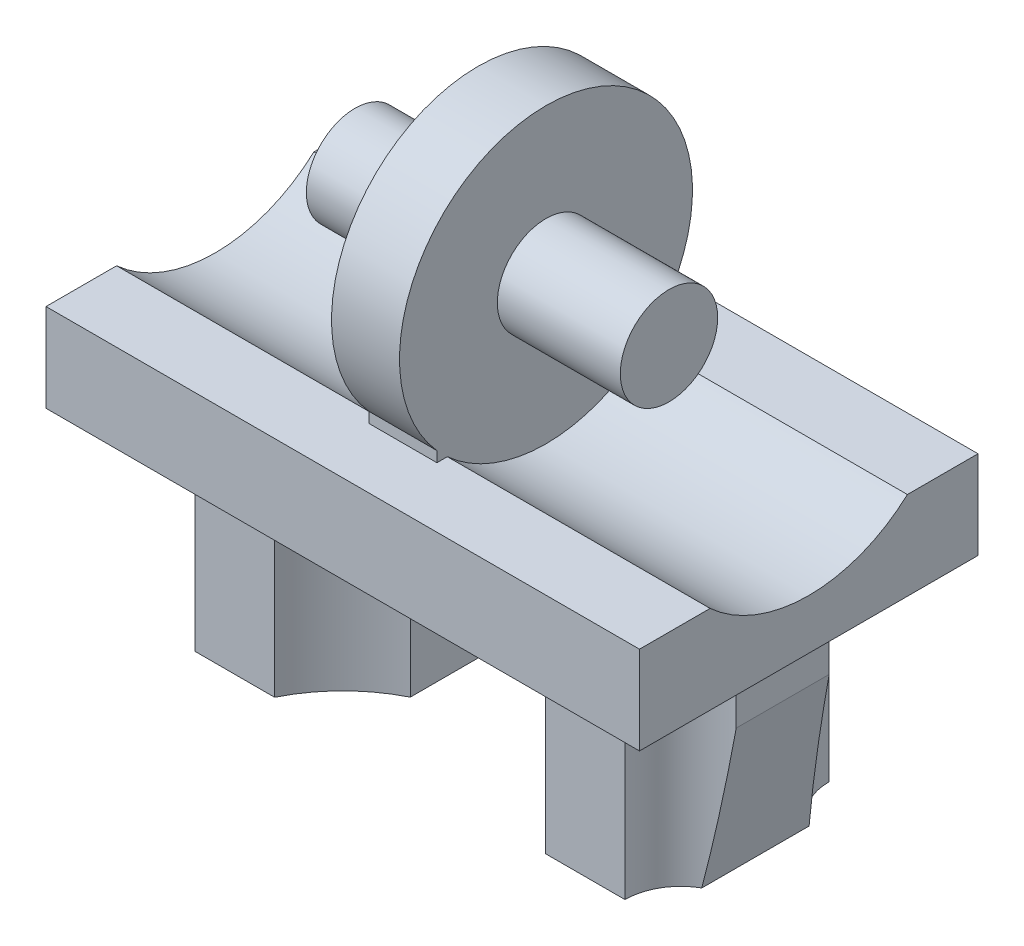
ISO-10303-21;
HEADER;
FILE_DESCRIPTION(('STEP AP214'),'2;1');
FILE_NAME('part.step','',(''),(''),'','','');
FILE_SCHEMA(('AUTOMOTIVE_DESIGN { 1 0 10303 214 1 1 1 1 }'));
ENDSEC;
DATA;
#1=APPLICATION_CONTEXT('core data for automotive mechanical design processes');
#2=APPLICATION_PROTOCOL_DEFINITION('international standard','automotive_design',2000,#1);
#3=PRODUCT_CONTEXT('',#1,'mechanical');
#4=PRODUCT('Part','Part','',(#3));
#5=PRODUCT_RELATED_PRODUCT_CATEGORY('part','',(#4));
#6=PRODUCT_DEFINITION_FORMATION('','',#4);
#7=PRODUCT_DEFINITION_CONTEXT('part definition',#1,'design');
#8=PRODUCT_DEFINITION('design','',#6,#7);
#9=PRODUCT_DEFINITION_SHAPE('','',#8);
#10=(LENGTH_UNIT() NAMED_UNIT(*) SI_UNIT(.MILLI.,.METRE.));
#11=(NAMED_UNIT(*) PLANE_ANGLE_UNIT() SI_UNIT($,.RADIAN.));
#12=(NAMED_UNIT(*) SI_UNIT($,.STERADIAN.) SOLID_ANGLE_UNIT());
#13=UNCERTAINTY_MEASURE_WITH_UNIT(LENGTH_MEASURE(1.E-05),#10,'distance_accuracy_value','');
#14=(GEOMETRIC_REPRESENTATION_CONTEXT(3) GLOBAL_UNCERTAINTY_ASSIGNED_CONTEXT((#13)) GLOBAL_UNIT_ASSIGNED_CONTEXT((#10,
#11,#12)) REPRESENTATION_CONTEXT('',''));
#15=CARTESIAN_POINT('',(0.,0.,0.));
#16=DIRECTION('',(0.,0.,1.));
#17=DIRECTION('',(1.,0.,0.));
#18=AXIS2_PLACEMENT_3D('',#15,#16,#17);
#19=CARTESIAN_POINT('',(3.74,3.4736,1.2064));
#20=DIRECTION('',(1.,0.,0.));
#21=DIRECTION('',(0.,0.,-1.));
#22=AXIS2_PLACEMENT_3D('',#19,#20,#21);
#23=PLANE('',#22);
#24=CARTESIAN_POINT('',(3.73999999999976,4.68,0.));
#25=DIRECTION('',(1.,0.,0.));
#26=DIRECTION('',(0.,0.,-1.));
#27=AXIS2_PLACEMENT_3D('',#24,#25,#26);
#28=CIRCLE('',#27,1.16);
#29=CARTESIAN_POINT('',(3.73999999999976,4.68,-1.16));
#30=VERTEX_POINT('',#29);
#31=EDGE_CURVE('E20',#30,#30,#28,.T.);
#32=ORIENTED_EDGE('',*,*,#31,.T.);
#33=EDGE_LOOP('',(#32));
#34=FACE_BOUND('',#33,.T.);
#35=ADVANCED_FACE('F16',(#34),#23,.T.);
#36=CARTESIAN_POINT('',(-7.3528,0.,4.1938));
#37=DIRECTION('',(0.,-1.,0.));
#38=DIRECTION('',(0.,0.,-1.));
#39=AXIS2_PLACEMENT_3D('',#36,#37,#38);
#40=PLANE('',#39);
#41=DIRECTION('',(0.,0.,1.));
#42=VECTOR('',#41,1.);
#43=CARTESIAN_POINT('',(-5.177740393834,0.,0.));
#44=LINE('',#43,#42);
#45=CARTESIAN_POINT('',(-5.17774039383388,0.,-1.19052334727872));
#46=VERTEX_POINT('',#45);
#47=CARTESIAN_POINT('',(-5.17774039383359,0.,1.19052334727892));
#48=VERTEX_POINT('',#47);
#49=EDGE_CURVE('E227',#46,#48,#44,.T.);
#50=ORIENTED_EDGE('',*,*,#49,.F.);
#51=CARTESIAN_POINT('',(-4.35,0.,0.));
#52=DIRECTION('',(0.,-1.,0.));
#53=DIRECTION('',(0.,0.,-1.));
#54=AXIS2_PLACEMENT_3D('',#51,#52,#53);
#55=CIRCLE('',#54,1.45);
#56=EDGE_CURVE('E232',#48,#46,#55,.F.);
#57=ORIENTED_EDGE('',*,*,#56,.F.);
#58=EDGE_LOOP('',(#50,#57));
#59=FACE_BOUND('',#58,.T.);
#60=ADVANCED_FACE('F239',(#59),#40,.T.);
#61=CARTESIAN_POINT('',(-7.3528,0.,4.1938));
#62=DIRECTION('',(0.,-1.,0.));
#63=DIRECTION('',(0.,0.,-1.));
#64=AXIS2_PLACEMENT_3D('',#61,#62,#63);
#65=PLANE('',#64);
#66=CARTESIAN_POINT('',(4.35,0.,0.));
#67=DIRECTION('',(0.,-1.,0.));
#68=DIRECTION('',(0.,0.,-1.));
#69=AXIS2_PLACEMENT_3D('',#66,#67,#68);
#70=CIRCLE('',#69,1.45);
#71=CARTESIAN_POINT('',(5.177740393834,0.,-1.19052334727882));
#72=VERTEX_POINT('',#71);
#73=CARTESIAN_POINT('',(5.177740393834,0.,1.19052334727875));
#74=VERTEX_POINT('',#73);
#75=EDGE_CURVE('E245',#72,#74,#70,.F.);
#76=ORIENTED_EDGE('',*,*,#75,.F.);
#77=DIRECTION('',(0.,0.,-1.));
#78=VECTOR('',#77,1.);
#79=CARTESIAN_POINT('',(5.177740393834,0.,0.));
#80=LINE('',#79,#78);
#81=EDGE_CURVE('E251',#74,#72,#80,.T.);
#82=ORIENTED_EDGE('',*,*,#81,.F.);
#83=EDGE_LOOP('',(#76,#82));
#84=FACE_BOUND('',#83,.T.);
#85=ADVANCED_FACE('F384',(#84),#65,.T.);
#86=CARTESIAN_POINT('',(0.809999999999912,4.68,0.));
#87=DIRECTION('',(1.,0.,0.));
#88=DIRECTION('',(0.,0.,-1.));
#89=AXIS2_PLACEMENT_3D('',#86,#87,#88);
#90=CYLINDRICAL_SURFACE('',#89,1.16);
#91=ORIENTED_EDGE('',*,*,#31,.F.);
#92=EDGE_LOOP('',(#91));
#93=FACE_BOUND('',#92,.T.);
#94=CARTESIAN_POINT('',(0.809999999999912,4.68,0.));
#95=DIRECTION('',(1.,0.,0.));
#96=DIRECTION('',(0.,0.,-1.));
#97=AXIS2_PLACEMENT_3D('',#94,#95,#96);
#98=CIRCLE('',#97,1.16);
#99=CARTESIAN_POINT('',(0.809999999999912,4.68,-1.16));
#100=VERTEX_POINT('',#99);
#101=EDGE_CURVE('E364',#100,#100,#98,.F.);
#102=ORIENTED_EDGE('',*,*,#101,.F.);
#103=EDGE_LOOP('',(#102));
#104=FACE_BOUND('',#103,.T.);
#105=ADVANCED_FACE('F386',(#93,#104),#90,.T.);
#106=CARTESIAN_POINT('',(-5.177740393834,0.0968,-1.23814428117));
#107=DIRECTION('',(1.,0.,0.));
#108=DIRECTION('',(0.,0.,1.));
#109=AXIS2_PLACEMENT_3D('',#106,#107,#108);
#110=PLANE('',#109);
#111=DIRECTION('',(0.,0.,1.));
#112=VECTOR('',#111,1.);
#113=CARTESIAN_POINT('',(-5.177740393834,-4.84,0.));
#114=LINE('',#113,#112);
#115=CARTESIAN_POINT('',(-5.17774039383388,-4.83999999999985,-1.19052334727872));
#116=VERTEX_POINT('',#115);
#117=CARTESIAN_POINT('',(-5.17774039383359,-4.83999999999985,1.19052334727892));
#118=VERTEX_POINT('',#117);
#119=EDGE_CURVE('E243',#116,#118,#114,.T.);
#120=ORIENTED_EDGE('',*,*,#119,.F.);
#121=DIRECTION('',(0.,-1.,0.));
#122=VECTOR('',#121,1.);
#123=CARTESIAN_POINT('',(-5.17774039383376,-2.42,-1.1905233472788));
#124=LINE('',#123,#122);
#125=EDGE_CURVE('E235',#46,#116,#124,.T.);
#126=ORIENTED_EDGE('',*,*,#125,.F.);
#127=ORIENTED_EDGE('',*,*,#49,.T.);
#128=DIRECTION('',(0.,1.,0.));
#129=VECTOR('',#128,1.);
#130=CARTESIAN_POINT('',(-5.17774039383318,-2.42,1.19052334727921));
#131=LINE('',#130,#129);
#132=EDGE_CURVE('E237',#118,#48,#131,.T.);
#133=ORIENTED_EDGE('',*,*,#132,.F.);
#134=EDGE_LOOP('',(#120,#126,#127,#133));
#135=FACE_BOUND('',#134,.T.);
#136=ADVANCED_FACE('F242',(#135),#110,.T.);
#137=CARTESIAN_POINT('',(-4.35,0.,0.));
#138=DIRECTION('',(0.,-1.,0.));
#139=DIRECTION('',(0.,0.,-1.));
#140=AXIS2_PLACEMENT_3D('',#137,#138,#139);
#141=CYLINDRICAL_SURFACE('',#140,1.45);
#142=CARTESIAN_POINT('',(-4.35,-4.83999999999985,0.));
#143=DIRECTION('',(0.,-1.,0.));
#144=DIRECTION('',(0.,0.,-1.));
#145=AXIS2_PLACEMENT_3D('',#142,#143,#144);
#146=CIRCLE('',#145,1.45);
#147=EDGE_CURVE('E361',#118,#116,#146,.F.);
#148=ORIENTED_EDGE('',*,*,#147,.F.);
#149=ORIENTED_EDGE('',*,*,#132,.T.);
#150=ORIENTED_EDGE('',*,*,#56,.T.);
#151=ORIENTED_EDGE('',*,*,#125,.T.);
#152=EDGE_LOOP('',(#148,#149,#150,#151));
#153=FACE_BOUND('',#152,.T.);
#154=ADVANCED_FACE('F234',(#153),#141,.F.);
#155=CARTESIAN_POINT('',(4.35,0.,0.));
#156=DIRECTION('',(0.,-1.,0.));
#157=DIRECTION('',(0.,0.,-1.));
#158=AXIS2_PLACEMENT_3D('',#155,#156,#157);
#159=CYLINDRICAL_SURFACE('',#158,1.45);
#160=CARTESIAN_POINT('',(4.35,-4.83999999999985,0.));
#161=DIRECTION('',(0.,-1.,0.));
#162=DIRECTION('',(0.,0.,-1.));
#163=AXIS2_PLACEMENT_3D('',#160,#161,#162);
#164=CIRCLE('',#163,1.45);
#165=CARTESIAN_POINT('',(5.177740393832,-4.83999999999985,-1.19052334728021));
#166=VERTEX_POINT('',#165);
#167=CARTESIAN_POINT('',(5.177740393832,-4.83999999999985,1.19052334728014));
#168=VERTEX_POINT('',#167);
#169=EDGE_CURVE('E352',#166,#168,#164,.F.);
#170=ORIENTED_EDGE('',*,*,#169,.F.);
#171=DIRECTION('',(0.,-1.,0.));
#172=VECTOR('',#171,1.);
#173=CARTESIAN_POINT('',(5.177740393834,-2.42,-1.190523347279));
#174=LINE('',#173,#172);
#175=EDGE_CURVE('E248',#72,#166,#174,.T.);
#176=ORIENTED_EDGE('',*,*,#175,.F.);
#177=ORIENTED_EDGE('',*,*,#75,.T.);
#178=DIRECTION('',(0.,1.,0.));
#179=VECTOR('',#178,1.);
#180=CARTESIAN_POINT('',(5.177740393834,-2.42,1.19052334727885));
#181=LINE('',#180,#179);
#182=EDGE_CURVE('E376',#168,#74,#181,.T.);
#183=ORIENTED_EDGE('',*,*,#182,.F.);
#184=EDGE_LOOP('',(#170,#176,#177,#183));
#185=FACE_BOUND('',#184,.T.);
#186=ADVANCED_FACE('F375',(#185),#159,.F.);
#187=CARTESIAN_POINT('',(5.177740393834,0.0968,1.23814428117));
#188=DIRECTION('',(-1.,0.,0.));
#189=DIRECTION('',(0.,0.,-1.));
#190=AXIS2_PLACEMENT_3D('',#187,#188,#189);
#191=PLANE('',#190);
#192=DIRECTION('',(0.,0.,-1.));
#193=VECTOR('',#192,1.);
#194=CARTESIAN_POINT('',(5.17774039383,-4.84,0.));
#195=LINE('',#194,#193);
#196=EDGE_CURVE('E354',#168,#166,#195,.T.);
#197=ORIENTED_EDGE('',*,*,#196,.F.);
#198=ORIENTED_EDGE('',*,*,#182,.T.);
#199=ORIENTED_EDGE('',*,*,#81,.T.);
#200=ORIENTED_EDGE('',*,*,#175,.T.);
#201=EDGE_LOOP('',(#197,#198,#199,#200));
#202=FACE_BOUND('',#201,.T.);
#203=ADVANCED_FACE('F381',(#202),#191,.T.);
#204=CARTESIAN_POINT('',(-3.74,3.4736,1.2064));
#205=DIRECTION('',(1.,0.,0.));
#206=DIRECTION('',(0.,0.,-1.));
#207=AXIS2_PLACEMENT_3D('',#204,#205,#206);
#208=PLANE('',#207);
#209=CARTESIAN_POINT('',(-3.73999999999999,4.68,0.));
#210=DIRECTION('',(1.,0.,0.));
#211=DIRECTION('',(0.,1.,0.));
#212=AXIS2_PLACEMENT_3D('',#209,#210,#211);
#213=CIRCLE('',#212,1.16);
#214=CARTESIAN_POINT('',(-3.73999999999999,5.84,0.));
#215=VERTEX_POINT('',#214);
#216=EDGE_CURVE('E344',#215,#215,#213,.F.);
#217=ORIENTED_EDGE('',*,*,#216,.T.);
#218=EDGE_LOOP('',(#217));
#219=FACE_BOUND('',#218,.T.);
#220=ADVANCED_FACE('F679',(#219),#208,.F.);
#221=CARTESIAN_POINT('',(0.81,1.0504,3.632449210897));
#222=DIRECTION('',(1.,0.,0.));
#223=DIRECTION('',(0.,0.,-1.));
#224=AXIS2_PLACEMENT_3D('',#221,#222,#223);
#225=PLANE('',#224);
#226=ORIENTED_EDGE('',*,*,#101,.T.);
#227=EDGE_LOOP('',(#226));
#228=FACE_BOUND('',#227,.T.);
#229=DIRECTION('',(0.,0.,-1.));
#230=VECTOR('',#229,1.);
#231=CARTESIAN_POINT('',(0.81,2.1,0.));
#232=LINE('',#231,#230);
#233=CARTESIAN_POINT('',(0.81,2.1,2.59830714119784));
#234=VERTEX_POINT('',#233);
#235=CARTESIAN_POINT('',(0.809999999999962,2.1,2.35025530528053));
#236=VERTEX_POINT('',#235);
#237=EDGE_CURVE('E368',#234,#236,#232,.T.);
#238=ORIENTED_EDGE('',*,*,#237,.T.);
#239=CARTESIAN_POINT('',(0.809999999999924,4.68,0.));
#240=DIRECTION('',(1.,0.,0.));
#241=DIRECTION('',(0.,0.,-1.));
#242=AXIS2_PLACEMENT_3D('',#239,#240,#241);
#243=CIRCLE('',#242,3.49);
#244=CARTESIAN_POINT('',(0.809999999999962,2.1,-2.35025530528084));
#245=VERTEX_POINT('',#244);
#246=EDGE_CURVE('E339',#245,#236,#243,.F.);
#247=ORIENTED_EDGE('',*,*,#246,.F.);
#248=DIRECTION('',(0.,0.,-1.));
#249=VECTOR('',#248,1.);
#250=CARTESIAN_POINT('',(0.81,2.1,0.));
#251=LINE('',#250,#249);
#252=CARTESIAN_POINT('',(0.81,2.10000000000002,-2.59830714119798));
#253=VERTEX_POINT('',#252);
#254=EDGE_CURVE('E383',#245,#253,#251,.T.);
#255=ORIENTED_EDGE('',*,*,#254,.T.);
#256=DIRECTION('',(0.,-1.,0.));
#257=VECTOR('',#256,1.);
#258=CARTESIAN_POINT('',(0.81,2.225,-2.598307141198));
#259=LINE('',#258,#257);
#260=CARTESIAN_POINT('',(0.809999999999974,2.34999999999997,-2.598307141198));
#261=VERTEX_POINT('',#260);
#262=EDGE_CURVE('E343',#261,#253,#259,.T.);
#263=ORIENTED_EDGE('',*,*,#262,.F.);
#264=CARTESIAN_POINT('',(0.809999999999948,4.68,0.));
#265=DIRECTION('',(1.,0.,0.));
#266=DIRECTION('',(0.,1.,0.));
#267=AXIS2_PLACEMENT_3D('',#264,#265,#266);
#268=CIRCLE('',#267,3.49);
#269=CARTESIAN_POINT('',(0.809999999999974,2.34999999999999,2.598307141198));
#270=VERTEX_POINT('',#269);
#271=EDGE_CURVE('E348',#261,#270,#268,.T.);
#272=ORIENTED_EDGE('',*,*,#271,.T.);
#273=DIRECTION('',(0.,-1.,0.));
#274=VECTOR('',#273,1.);
#275=CARTESIAN_POINT('',(0.81,4.68,2.598307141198));
#276=LINE('',#275,#274);
#277=EDGE_CURVE('E587',#270,#234,#276,.T.);
#278=ORIENTED_EDGE('',*,*,#277,.T.);
#279=EDGE_LOOP('',(#238,#247,#255,#263,#272,#278));
#280=FACE_BOUND('',#279,.T.);
#281=ADVANCED_FACE('F586',(#228,#280),#225,.T.);
#282=CARTESIAN_POINT('',(-5.787,-4.9108,-1.328889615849));
#283=DIRECTION('',(0.983557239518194,0.180596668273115,0.));
#284=DIRECTION('',(-0.180596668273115,0.983557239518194,0.));
#285=AXIS2_PLACEMENT_3D('',#282,#283,#284);
#286=PLANE('',#285);
#287=CARTESIAN_POINT('',(-6.45,-1.3,2.4325));
#288=DIRECTION('',(0.983557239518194,0.180596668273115,0.));
#289=DIRECTION('',(0.180596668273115,-0.983557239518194,0.));
#290=AXIS2_PLACEMENT_3D('',#287,#288,#289);
#291=ELLIPSE('',#290,7.33732750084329,1.325096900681);
#292=CARTESIAN_POINT('',(-6.44999999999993,-1.30000000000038,1.107403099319));
#293=VERTEX_POINT('',#292);
#294=CARTESIAN_POINT('',(-5.80000000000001,-4.83999999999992,1.27777847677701));
#295=VERTEX_POINT('',#294);
#296=EDGE_CURVE('E324',#293,#295,#291,.F.);
#297=ORIENTED_EDGE('',*,*,#296,.F.);
#298=DIRECTION('',(0.,0.,1.));
#299=VECTOR('',#298,1.);
#300=CARTESIAN_POINT('',(-6.45,-1.3,0.));
#301=LINE('',#300,#299);
#302=CARTESIAN_POINT('',(-6.45,-1.3,-1.10740309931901));
#303=VERTEX_POINT('',#302);
#304=EDGE_CURVE('E330',#303,#293,#301,.T.);
#305=ORIENTED_EDGE('',*,*,#304,.F.);
#306=CARTESIAN_POINT('',(-6.45,-1.3,-2.4325));
#307=DIRECTION('',(0.983557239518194,0.180596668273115,0.));
#308=DIRECTION('',(0.180596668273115,-0.983557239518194,0.));
#309=AXIS2_PLACEMENT_3D('',#306,#307,#308);
#310=ELLIPSE('',#309,7.33732750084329,1.325096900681);
#311=CARTESIAN_POINT('',(-5.80000000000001,-4.83999999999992,-1.27777847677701));
#312=VERTEX_POINT('',#311);
#313=EDGE_CURVE('E332',#312,#303,#310,.F.);
#314=ORIENTED_EDGE('',*,*,#313,.F.);
#315=DIRECTION('',(0.,0.,-1.));
#316=VECTOR('',#315,1.);
#317=CARTESIAN_POINT('',(-5.8,-4.84,0.));
#318=LINE('',#317,#316);
#319=EDGE_CURVE('E367',#295,#312,#318,.T.);
#320=ORIENTED_EDGE('',*,*,#319,.F.);
#321=EDGE_LOOP('',(#297,#305,#314,#320));
#322=FACE_BOUND('',#321,.T.);
#323=ADVANCED_FACE('F678',(#322),#286,.F.);
#324=CARTESIAN_POINT('',(6.032,-4.84,2.5298));
#325=DIRECTION('',(0.,-1.,0.));
#326=DIRECTION('',(-1.,0.,0.));
#327=AXIS2_PLACEMENT_3D('',#324,#325,#326);
#328=PLANE('',#327);
#329=ORIENTED_EDGE('',*,*,#119,.T.);
#330=ORIENTED_EDGE('',*,*,#147,.T.);
#331=EDGE_LOOP('',(#329,#330));
#332=FACE_BOUND('',#331,.T.);
#333=DIRECTION('',(1.,0.,0.));
#334=VECTOR('',#333,1.);
#335=CARTESIAN_POINT('',(-4.174903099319,-4.84,2.4325));
#336=LINE('',#335,#334);
#337=CARTESIAN_POINT('',(-5.124903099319,-4.83999999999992,2.4325));
#338=VERTEX_POINT('',#337);
#339=CARTESIAN_POINT('',(-3.22490309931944,-4.83999999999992,2.43250000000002));
#340=VERTEX_POINT('',#339);
#341=EDGE_CURVE('E466',#338,#340,#336,.T.);
#342=ORIENTED_EDGE('',*,*,#341,.F.);
#343=CARTESIAN_POINT('',(-6.45,-4.83999999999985,2.4325));
#344=DIRECTION('',(0.,-1.,0.));
#345=DIRECTION('',(0.,0.,-1.));
#346=AXIS2_PLACEMENT_3D('',#343,#344,#345);
#347=CIRCLE('',#346,1.325096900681);
#348=EDGE_CURVE('E321',#295,#338,#347,.T.);
#349=ORIENTED_EDGE('',*,*,#348,.F.);
#350=ORIENTED_EDGE('',*,*,#319,.T.);
#351=CARTESIAN_POINT('',(-6.45,-4.83999999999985,-2.4325));
#352=DIRECTION('',(0.,-1.,0.));
#353=DIRECTION('',(0.,0.,-1.));
#354=AXIS2_PLACEMENT_3D('',#351,#352,#353);
#355=CIRCLE('',#354,1.325096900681);
#356=CARTESIAN_POINT('',(-5.124903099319,-4.83999999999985,-2.43249999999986));
#357=VERTEX_POINT('',#356);
#358=EDGE_CURVE('E327',#357,#312,#355,.T.);
#359=ORIENTED_EDGE('',*,*,#358,.F.);
#360=DIRECTION('',(-1.,0.,0.));
#361=VECTOR('',#360,1.);
#362=CARTESIAN_POINT('',(-4.174903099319,-4.84,-2.4325));
#363=LINE('',#362,#361);
#364=CARTESIAN_POINT('',(-3.22490309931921,-4.83999999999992,-2.4325));
#365=VERTEX_POINT('',#364);
#366=EDGE_CURVE('E334',#365,#357,#363,.T.);
#367=ORIENTED_EDGE('',*,*,#366,.F.);
#368=CARTESIAN_POINT('',(0.,-4.83999999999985,-4.0325));
#369=DIRECTION('',(0.,-1.,0.));
#370=DIRECTION('',(0.,0.,-1.));
#371=AXIS2_PLACEMENT_3D('',#368,#369,#370);
#372=CIRCLE('',#371,3.6);
#373=CARTESIAN_POINT('',(-1.60999999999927,-4.83999999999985,-0.812577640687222));
#374=VERTEX_POINT('',#373);
#375=EDGE_CURVE('E335',#374,#365,#372,.T.);
#376=ORIENTED_EDGE('',*,*,#375,.F.);
#377=DIRECTION('',(0.,0.,-1.));
#378=VECTOR('',#377,1.);
#379=CARTESIAN_POINT('',(-1.61,-4.84,0.));
#380=LINE('',#379,#378);
#381=CARTESIAN_POINT('',(-1.61000000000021,-4.83999999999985,0.812577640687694));
#382=VERTEX_POINT('',#381);
#383=EDGE_CURVE('E363',#382,#374,#380,.T.);
#384=ORIENTED_EDGE('',*,*,#383,.F.);
#385=CARTESIAN_POINT('',(0.,-4.83999999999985,4.0325));
#386=DIRECTION('',(0.,-1.,0.));
#387=DIRECTION('',(0.,0.,-1.));
#388=AXIS2_PLACEMENT_3D('',#385,#386,#387);
#389=CIRCLE('',#388,3.6);
#390=EDGE_CURVE('E317',#340,#382,#389,.T.);
#391=ORIENTED_EDGE('',*,*,#390,.F.);
#392=EDGE_LOOP('',(#342,#349,#350,#359,#367,#376,#384,#391));
#393=FACE_BOUND('',#392,.T.);
#394=ADVANCED_FACE('F685',(#332,#393),#328,.T.);
#395=CARTESIAN_POINT('',(-1.61,0.0968,-0.8450807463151));
#396=DIRECTION('',(1.,0.,0.));
#397=DIRECTION('',(0.,0.,1.));
#398=AXIS2_PLACEMENT_3D('',#395,#396,#397);
#399=PLANE('',#398);
#400=DIRECTION('',(0.,0.,1.));
#401=VECTOR('',#400,1.);
#402=CARTESIAN_POINT('',(-1.61,0.,0.));
#403=LINE('',#402,#401);
#404=CARTESIAN_POINT('',(-1.60999999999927,0.,-0.812577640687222));
#405=VERTEX_POINT('',#404);
#406=CARTESIAN_POINT('',(-1.61000000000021,0.,0.812577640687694));
#407=VERTEX_POINT('',#406);
#408=EDGE_CURVE('E527',#405,#407,#403,.T.);
#409=ORIENTED_EDGE('',*,*,#408,.T.);
#410=DIRECTION('',(0.,1.,0.));
#411=VECTOR('',#410,1.);
#412=CARTESIAN_POINT('',(-1.61000000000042,-2.42,0.8125776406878));
#413=LINE('',#412,#411);
#414=EDGE_CURVE('E319',#382,#407,#413,.T.);
#415=ORIENTED_EDGE('',*,*,#414,.F.);
#416=ORIENTED_EDGE('',*,*,#383,.T.);
#417=DIRECTION('',(0.,-1.,0.));
#418=VECTOR('',#417,1.);
#419=CARTESIAN_POINT('',(-1.60999999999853,-2.42,-0.812577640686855));
#420=LINE('',#419,#418);
#421=EDGE_CURVE('E338',#405,#374,#420,.T.);
#422=ORIENTED_EDGE('',*,*,#421,.F.);
#423=EDGE_LOOP('',(#409,#415,#416,#422));
#424=FACE_BOUND('',#423,.T.);
#425=ADVANCED_FACE('F694',(#424),#399,.T.);
#426=CARTESIAN_POINT('',(1.61,0.0968,0.8450807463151));
#427=DIRECTION('',(-1.,0.,0.));
#428=DIRECTION('',(0.,0.,-1.));
#429=AXIS2_PLACEMENT_3D('',#426,#427,#428);
#430=PLANE('',#429);
#431=DIRECTION('',(0.,0.,-1.));
#432=VECTOR('',#431,1.);
#433=CARTESIAN_POINT('',(1.61,0.,0.));
#434=LINE('',#433,#432);
#435=CARTESIAN_POINT('',(1.61000000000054,0.,0.812577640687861));
#436=VERTEX_POINT('',#435);
#437=CARTESIAN_POINT('',(1.60999999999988,0.,-0.812577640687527));
#438=VERTEX_POINT('',#437);
#439=EDGE_CURVE('E360',#436,#438,#434,.T.);
#440=ORIENTED_EDGE('',*,*,#439,.T.);
#441=DIRECTION('',(0.,1.,0.));
#442=VECTOR('',#441,1.);
#443=CARTESIAN_POINT('',(1.60999999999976,-2.42,-0.812577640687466));
#444=LINE('',#443,#442);
#445=CARTESIAN_POINT('',(1.60999999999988,-4.83999999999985,-0.812577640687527));
#446=VERTEX_POINT('',#445);
#447=EDGE_CURVE('E315',#446,#438,#444,.T.);
#448=ORIENTED_EDGE('',*,*,#447,.F.);
#449=DIRECTION('',(0.,0.,-1.));
#450=VECTOR('',#449,1.);
#451=CARTESIAN_POINT('',(1.61,-4.84,0.));
#452=LINE('',#451,#450);
#453=CARTESIAN_POINT('',(1.61000000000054,-4.83999999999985,0.812577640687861));
#454=VERTEX_POINT('',#453);
#455=EDGE_CURVE('E355',#454,#446,#452,.T.);
#456=ORIENTED_EDGE('',*,*,#455,.F.);
#457=DIRECTION('',(0.,-1.,0.));
#458=VECTOR('',#457,1.);
#459=CARTESIAN_POINT('',(1.61000000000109,-2.42,0.812577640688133));
#460=LINE('',#459,#458);
#461=EDGE_CURVE('E311',#436,#454,#460,.T.);
#462=ORIENTED_EDGE('',*,*,#461,.F.);
#463=EDGE_LOOP('',(#440,#448,#456,#462));
#464=FACE_BOUND('',#463,.T.);
#465=ADVANCED_FACE('F698',(#464),#430,.T.);
#466=CARTESIAN_POINT('',(6.032,-4.84,2.5298));
#467=DIRECTION('',(0.,-1.,0.));
#468=DIRECTION('',(-1.,0.,0.));
#469=AXIS2_PLACEMENT_3D('',#466,#467,#468);
#470=PLANE('',#469);
#471=ORIENTED_EDGE('',*,*,#169,.T.);
#472=ORIENTED_EDGE('',*,*,#196,.T.);
#473=EDGE_LOOP('',(#471,#472));
#474=FACE_BOUND('',#473,.T.);
#475=CARTESIAN_POINT('',(0.,-4.83999999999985,-4.0325));
#476=DIRECTION('',(0.,-1.,0.));
#477=DIRECTION('',(0.,0.,-1.));
#478=AXIS2_PLACEMENT_3D('',#475,#476,#477);
#479=CIRCLE('',#478,3.6);
#480=CARTESIAN_POINT('',(3.22490309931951,-4.83999999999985,-2.43250000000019));
#481=VERTEX_POINT('',#480);
#482=EDGE_CURVE('E312',#481,#446,#479,.T.);
#483=ORIENTED_EDGE('',*,*,#482,.F.);
#484=DIRECTION('',(-1.,0.,0.));
#485=VECTOR('',#484,1.);
#486=CARTESIAN_POINT('',(4.174903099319,-4.84,-2.4325));
#487=LINE('',#486,#485);
#488=CARTESIAN_POINT('',(5.124903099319,-4.83999999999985,-2.43250000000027));
#489=VERTEX_POINT('',#488);
#490=EDGE_CURVE('E461',#489,#481,#487,.T.);
#491=ORIENTED_EDGE('',*,*,#490,.F.);
#492=CARTESIAN_POINT('',(6.45,-4.83999999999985,-2.4325));
#493=DIRECTION('',(0.,-1.,0.));
#494=DIRECTION('',(0.,0.,-1.));
#495=AXIS2_PLACEMENT_3D('',#492,#493,#494);
#496=CIRCLE('',#495,1.325096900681);
#497=CARTESIAN_POINT('',(5.79999999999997,-4.84000000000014,-1.27777847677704));
#498=VERTEX_POINT('',#497);
#499=EDGE_CURVE('E358',#489,#498,#496,.F.);
#500=ORIENTED_EDGE('',*,*,#499,.T.);
#501=DIRECTION('',(0.,0.,1.));
#502=VECTOR('',#501,1.);
#503=CARTESIAN_POINT('',(5.79999999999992,-4.84000000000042,0.));
#504=LINE('',#503,#502);
#505=CARTESIAN_POINT('',(5.79999999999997,-4.84000000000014,1.27777847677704));
#506=VERTEX_POINT('',#505);
#507=EDGE_CURVE('E351',#498,#506,#504,.T.);
#508=ORIENTED_EDGE('',*,*,#507,.T.);
#509=CARTESIAN_POINT('',(6.45,-4.83999999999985,2.4325));
#510=DIRECTION('',(0.,-1.,0.));
#511=DIRECTION('',(0.,0.,-1.));
#512=AXIS2_PLACEMENT_3D('',#509,#510,#511);
#513=CIRCLE('',#512,1.325096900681);
#514=CARTESIAN_POINT('',(5.124903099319,-4.83999999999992,2.4325));
#515=VERTEX_POINT('',#514);
#516=EDGE_CURVE('E356',#506,#515,#513,.F.);
#517=ORIENTED_EDGE('',*,*,#516,.T.);
#518=DIRECTION('',(1.,0.,0.));
#519=VECTOR('',#518,1.);
#520=CARTESIAN_POINT('',(4.174903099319,-4.84,2.4325));
#521=LINE('',#520,#519);
#522=CARTESIAN_POINT('',(3.22490309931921,-4.83999999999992,2.4325));
#523=VERTEX_POINT('',#522);
#524=EDGE_CURVE('E307',#523,#515,#521,.T.);
#525=ORIENTED_EDGE('',*,*,#524,.F.);
#526=CARTESIAN_POINT('',(0.,-4.83999999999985,4.0325));
#527=DIRECTION('',(0.,-1.,0.));
#528=DIRECTION('',(0.,0.,-1.));
#529=AXIS2_PLACEMENT_3D('',#526,#527,#528);
#530=CIRCLE('',#529,3.6);
#531=EDGE_CURVE('E308',#454,#523,#530,.T.);
#532=ORIENTED_EDGE('',*,*,#531,.F.);
#533=ORIENTED_EDGE('',*,*,#455,.T.);
#534=EDGE_LOOP('',(#483,#491,#500,#508,#517,#525,#532,#533));
#535=FACE_BOUND('',#534,.T.);
#536=ADVANCED_FACE('F619',(#474,#535),#470,.T.);
#537=CARTESIAN_POINT('',(6.463,-1.2292,-1.328889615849));
#538=DIRECTION('',(-0.983557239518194,0.180596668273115,0.));
#539=DIRECTION('',(-0.180596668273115,-0.983557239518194,0.));
#540=AXIS2_PLACEMENT_3D('',#537,#538,#539);
#541=PLANE('',#540);
#542=CARTESIAN_POINT('',(6.45,-1.3,-2.4325));
#543=DIRECTION('',(-0.983557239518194,0.180596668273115,0.));
#544=DIRECTION('',(-0.180596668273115,-0.983557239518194,0.));
#545=AXIS2_PLACEMENT_3D('',#542,#543,#544);
#546=ELLIPSE('',#545,7.33732750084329,1.325096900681);
#547=CARTESIAN_POINT('',(6.4499999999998,-1.30000000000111,-1.107403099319));
#548=VERTEX_POINT('',#547);
#549=EDGE_CURVE('E300',#548,#498,#546,.F.);
#550=ORIENTED_EDGE('',*,*,#549,.F.);
#551=DIRECTION('',(0.,0.,-1.));
#552=VECTOR('',#551,1.);
#553=CARTESIAN_POINT('',(6.45,-1.3,0.));
#554=LINE('',#553,#552);
#555=CARTESIAN_POINT('',(6.45,-1.3,1.10740309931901));
#556=VERTEX_POINT('',#555);
#557=EDGE_CURVE('E446',#556,#548,#554,.T.);
#558=ORIENTED_EDGE('',*,*,#557,.F.);
#559=CARTESIAN_POINT('',(6.45,-1.3,2.4325));
#560=DIRECTION('',(-0.983557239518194,0.180596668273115,0.));
#561=DIRECTION('',(-0.180596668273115,-0.983557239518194,0.));
#562=AXIS2_PLACEMENT_3D('',#559,#560,#561);
#563=ELLIPSE('',#562,7.33732750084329,1.325096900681);
#564=EDGE_CURVE('E304',#506,#556,#563,.F.);
#565=ORIENTED_EDGE('',*,*,#564,.F.);
#566=ORIENTED_EDGE('',*,*,#507,.F.);
#567=EDGE_LOOP('',(#550,#558,#565,#566));
#568=FACE_BOUND('',#567,.T.);
#569=ADVANCED_FACE('F611',(#568),#541,.F.);
#570=CARTESIAN_POINT('',(-0.809999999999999,4.68,0.));
#571=DIRECTION('',(1.,0.,0.));
#572=DIRECTION('',(0.,1.,0.));
#573=AXIS2_PLACEMENT_3D('',#570,#571,#572);
#574=CYLINDRICAL_SURFACE('',#573,3.49);
#575=ORIENTED_EDGE('',*,*,#271,.F.);
#576=DIRECTION('',(1.,0.,0.));
#577=VECTOR('',#576,1.);
#578=CARTESIAN_POINT('',(0.,2.34999999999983,-2.598307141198));
#579=LINE('',#578,#577);
#580=CARTESIAN_POINT('',(-0.809999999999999,2.34999999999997,-2.598307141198));
#581=VERTEX_POINT('',#580);
#582=EDGE_CURVE('E347',#581,#261,#579,.T.);
#583=ORIENTED_EDGE('',*,*,#582,.F.);
#584=CARTESIAN_POINT('',(-0.809999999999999,4.68,0.));
#585=DIRECTION('',(1.,0.,0.));
#586=DIRECTION('',(0.,1.,0.));
#587=AXIS2_PLACEMENT_3D('',#584,#585,#586);
#588=CIRCLE('',#587,3.49);
#589=CARTESIAN_POINT('',(-0.809999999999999,2.34999999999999,2.598307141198));
#590=VERTEX_POINT('',#589);
#591=EDGE_CURVE('E296',#581,#590,#588,.T.);
#592=ORIENTED_EDGE('',*,*,#591,.T.);
#593=DIRECTION('',(-1.,0.,0.));
#594=VECTOR('',#593,1.);
#595=CARTESIAN_POINT('',(0.,2.34999999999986,2.598307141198));
#596=LINE('',#595,#594);
#597=EDGE_CURVE('E342',#270,#590,#596,.T.);
#598=ORIENTED_EDGE('',*,*,#597,.F.);
#599=EDGE_LOOP('',(#575,#583,#592,#598));
#600=FACE_BOUND('',#599,.T.);
#601=ADVANCED_FACE('F608',(#600),#574,.T.);
#602=CARTESIAN_POINT('',(-3.73999999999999,4.68,0.));
#603=DIRECTION('',(1.,0.,0.));
#604=DIRECTION('',(0.,1.,0.));
#605=AXIS2_PLACEMENT_3D('',#602,#603,#604);
#606=CYLINDRICAL_SURFACE('',#605,1.16);
#607=ORIENTED_EDGE('',*,*,#216,.F.);
#608=EDGE_LOOP('',(#607));
#609=FACE_BOUND('',#608,.T.);
#610=CARTESIAN_POINT('',(-0.80999999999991,4.68,0.));
#611=DIRECTION('',(1.,0.,0.));
#612=DIRECTION('',(0.,1.,0.));
#613=AXIS2_PLACEMENT_3D('',#610,#611,#612);
#614=CIRCLE('',#613,1.16);
#615=CARTESIAN_POINT('',(-0.80999999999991,5.84,0.));
#616=VERTEX_POINT('',#615);
#617=EDGE_CURVE('E291',#616,#616,#614,.F.);
#618=ORIENTED_EDGE('',*,*,#617,.T.);
#619=EDGE_LOOP('',(#618));
#620=FACE_BOUND('',#619,.T.);
#621=ADVANCED_FACE('F610',(#609,#620),#606,.T.);
#622=CARTESIAN_POINT('',(-0.8424,2.074993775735,-2.598307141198));
#623=DIRECTION('',(0.,0.,-1.));
#624=DIRECTION('',(0.,1.,0.));
#625=AXIS2_PLACEMENT_3D('',#622,#623,#624);
#626=PLANE('',#625);
#627=ORIENTED_EDGE('',*,*,#582,.T.);
#628=ORIENTED_EDGE('',*,*,#262,.T.);
#629=DIRECTION('',(1.,0.,0.));
#630=VECTOR('',#629,1.);
#631=CARTESIAN_POINT('',(0.,2.1,-2.59830714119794));
#632=LINE('',#631,#630);
#633=CARTESIAN_POINT('',(-0.81,2.1,-2.59830714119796));
#634=VERTEX_POINT('',#633);
#635=EDGE_CURVE('E441',#634,#253,#632,.T.);
#636=ORIENTED_EDGE('',*,*,#635,.F.);
#637=DIRECTION('',(0.,1.,0.));
#638=VECTOR('',#637,1.);
#639=CARTESIAN_POINT('',(-0.81,4.68,-2.598307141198));
#640=LINE('',#639,#638);
#641=EDGE_CURVE('E299',#634,#581,#640,.T.);
#642=ORIENTED_EDGE('',*,*,#641,.T.);
#643=EDGE_LOOP('',(#627,#628,#636,#642));
#644=FACE_BOUND('',#643,.T.);
#645=ADVANCED_FACE('F539',(#644),#626,.T.);
#646=CARTESIAN_POINT('',(0.809999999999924,4.68,0.));
#647=DIRECTION('',(1.,0.,0.));
#648=DIRECTION('',(0.,0.,-1.));
#649=AXIS2_PLACEMENT_3D('',#646,#647,#648);
#650=CYLINDRICAL_SURFACE('',#649,3.49);
#651=CARTESIAN_POINT('',(7.06999999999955,4.68,0.));
#652=DIRECTION('',(1.,0.,0.));
#653=DIRECTION('',(0.,0.,-1.));
#654=AXIS2_PLACEMENT_3D('',#651,#652,#653);
#655=CIRCLE('',#654,3.49);
#656=CARTESIAN_POINT('',(7.06999999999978,2.1,-2.35025530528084));
#657=VERTEX_POINT('',#656);
#658=CARTESIAN_POINT('',(7.06999999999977,2.1,2.35025530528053));
#659=VERTEX_POINT('',#658);
#660=EDGE_CURVE('E287',#657,#659,#655,.F.);
#661=ORIENTED_EDGE('',*,*,#660,.F.);
#662=DIRECTION('',(1.,0.,0.));
#663=VECTOR('',#662,1.);
#664=CARTESIAN_POINT('',(0.,2.1,-2.35025530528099));
#665=LINE('',#664,#663);
#666=EDGE_CURVE('E437',#245,#657,#665,.T.);
#667=ORIENTED_EDGE('',*,*,#666,.F.);
#668=ORIENTED_EDGE('',*,*,#246,.T.);
#669=DIRECTION('',(-1.,0.,0.));
#670=VECTOR('',#669,1.);
#671=CARTESIAN_POINT('',(0.,2.1,2.35025530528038));
#672=LINE('',#671,#670);
#673=EDGE_CURVE('E482',#659,#236,#672,.T.);
#674=ORIENTED_EDGE('',*,*,#673,.F.);
#675=EDGE_LOOP('',(#661,#667,#668,#674));
#676=FACE_BOUND('',#675,.T.);
#677=ADVANCED_FACE('F584',(#676),#650,.F.);
#678=CARTESIAN_POINT('',(-0.8424,2.375006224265,2.598307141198));
#679=DIRECTION('',(0.,0.,1.));
#680=DIRECTION('',(0.,-1.,0.));
#681=AXIS2_PLACEMENT_3D('',#678,#679,#680);
#682=PLANE('',#681);
#683=ORIENTED_EDGE('',*,*,#597,.T.);
#684=DIRECTION('',(0.,-1.,0.));
#685=VECTOR('',#684,1.);
#686=CARTESIAN_POINT('',(-0.81,4.68,2.598307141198));
#687=LINE('',#686,#685);
#688=CARTESIAN_POINT('',(-0.81,2.1,2.59830714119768));
#689=VERTEX_POINT('',#688);
#690=EDGE_CURVE('E295',#590,#689,#687,.T.);
#691=ORIENTED_EDGE('',*,*,#690,.T.);
#692=DIRECTION('',(-1.,0.,0.));
#693=VECTOR('',#692,1.);
#694=CARTESIAN_POINT('',(0.,2.1,2.59830714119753));
#695=LINE('',#694,#693);
#696=EDGE_CURVE('E487',#234,#689,#695,.T.);
#697=ORIENTED_EDGE('',*,*,#696,.F.);
#698=ORIENTED_EDGE('',*,*,#277,.F.);
#699=EDGE_LOOP('',(#683,#691,#697,#698));
#700=FACE_BOUND('',#699,.T.);
#701=ADVANCED_FACE('F605',(#700),#682,.T.);
#702=CARTESIAN_POINT('',(0.,0.,-4.0325));
#703=DIRECTION('',(0.,-1.,0.));
#704=DIRECTION('',(0.,0.,-1.));
#705=AXIS2_PLACEMENT_3D('',#702,#703,#704);
#706=CYLINDRICAL_SURFACE('',#705,3.6);
#707=ORIENTED_EDGE('',*,*,#375,.T.);
#708=DIRECTION('',(0.,-1.,0.));
#709=VECTOR('',#708,1.);
#710=CARTESIAN_POINT('',(-3.224903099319,-2.42,-2.4325));
#711=LINE('',#710,#709);
#712=CARTESIAN_POINT('',(-3.22490309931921,0.,-2.4325));
#713=VERTEX_POINT('',#712);
#714=EDGE_CURVE('E337',#713,#365,#711,.T.);
#715=ORIENTED_EDGE('',*,*,#714,.F.);
#716=CARTESIAN_POINT('',(0.,0.,-4.0325));
#717=DIRECTION('',(0.,-1.,0.));
#718=DIRECTION('',(0.,0.,-1.));
#719=AXIS2_PLACEMENT_3D('',#716,#717,#718);
#720=CIRCLE('',#719,3.6);
#721=EDGE_CURVE('E284',#405,#713,#720,.T.);
#722=ORIENTED_EDGE('',*,*,#721,.F.);
#723=ORIENTED_EDGE('',*,*,#421,.T.);
#724=EDGE_LOOP('',(#707,#715,#722,#723));
#725=FACE_BOUND('',#724,.T.);
#726=ADVANCED_FACE('F627',(#725),#706,.F.);
#727=CARTESIAN_POINT('',(-5.162903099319,0.0968,-2.4325));
#728=DIRECTION('',(0.,0.,-1.));
#729=DIRECTION('',(1.,0.,0.));
#730=AXIS2_PLACEMENT_3D('',#727,#728,#729);
#731=PLANE('',#730);
#732=ORIENTED_EDGE('',*,*,#366,.T.);
#733=DIRECTION('',(0.,-1.,0.));
#734=VECTOR('',#733,1.);
#735=CARTESIAN_POINT('',(-5.124903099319,-2.42,-2.43249999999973));
#736=LINE('',#735,#734);
#737=CARTESIAN_POINT('',(-5.124903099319,0.,-2.43249999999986));
#738=VERTEX_POINT('',#737);
#739=EDGE_CURVE('E331',#738,#357,#736,.T.);
#740=ORIENTED_EDGE('',*,*,#739,.F.);
#741=DIRECTION('',(-1.,0.,0.));
#742=VECTOR('',#741,1.);
#743=CARTESIAN_POINT('',(0.,0.,-2.4325));
#744=LINE('',#743,#742);
#745=EDGE_CURVE('E283',#713,#738,#744,.T.);
#746=ORIENTED_EDGE('',*,*,#745,.F.);
#747=ORIENTED_EDGE('',*,*,#714,.T.);
#748=EDGE_LOOP('',(#732,#740,#746,#747));
#749=FACE_BOUND('',#748,.T.);
#750=ADVANCED_FACE('F630',(#749),#731,.T.);
#751=CARTESIAN_POINT('',(-6.45,0.,-2.4325));
#752=DIRECTION('',(0.,-1.,0.));
#753=DIRECTION('',(0.,0.,-1.));
#754=AXIS2_PLACEMENT_3D('',#751,#752,#753);
#755=CYLINDRICAL_SURFACE('',#754,1.325096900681);
#756=ORIENTED_EDGE('',*,*,#739,.T.);
#757=ORIENTED_EDGE('',*,*,#358,.T.);
#758=ORIENTED_EDGE('',*,*,#313,.T.);
#759=DIRECTION('',(0.,-1.,0.));
#760=VECTOR('',#759,1.);
#761=CARTESIAN_POINT('',(-6.45,-0.65,-1.10740309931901));
#762=LINE('',#761,#760);
#763=CARTESIAN_POINT('',(-6.45,0.,-1.10740309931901));
#764=VERTEX_POINT('',#763);
#765=EDGE_CURVE('E326',#764,#303,#762,.T.);
#766=ORIENTED_EDGE('',*,*,#765,.F.);
#767=CARTESIAN_POINT('',(-6.45,0.,-2.4325));
#768=DIRECTION('',(0.,-1.,0.));
#769=DIRECTION('',(0.,0.,-1.));
#770=AXIS2_PLACEMENT_3D('',#767,#768,#769);
#771=CIRCLE('',#770,1.325096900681);
#772=EDGE_CURVE('E281',#738,#764,#771,.T.);
#773=ORIENTED_EDGE('',*,*,#772,.F.);
#774=EDGE_LOOP('',(#756,#757,#758,#766,#773));
#775=FACE_BOUND('',#774,.T.);
#776=ADVANCED_FACE('F632',(#775),#755,.F.);
#777=CARTESIAN_POINT('',(-6.45,0.026,1.151699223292));
#778=DIRECTION('',(-1.,0.,0.));
#779=DIRECTION('',(0.,0.,-1.));
#780=AXIS2_PLACEMENT_3D('',#777,#778,#779);
#781=PLANE('',#780);
#782=DIRECTION('',(0.,0.,1.));
#783=VECTOR('',#782,1.);
#784=CARTESIAN_POINT('',(-6.45,0.,0.));
#785=LINE('',#784,#783);
#786=CARTESIAN_POINT('',(-6.44999999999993,0.,1.107403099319));
#787=VERTEX_POINT('',#786);
#788=EDGE_CURVE('E280',#764,#787,#785,.T.);
#789=ORIENTED_EDGE('',*,*,#788,.F.);
#790=ORIENTED_EDGE('',*,*,#765,.T.);
#791=ORIENTED_EDGE('',*,*,#304,.T.);
#792=DIRECTION('',(0.,-1.,0.));
#793=VECTOR('',#792,1.);
#794=CARTESIAN_POINT('',(-6.44999999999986,-2.42,1.107403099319));
#795=LINE('',#794,#793);
#796=EDGE_CURVE('E323',#787,#293,#795,.T.);
#797=ORIENTED_EDGE('',*,*,#796,.F.);
#798=EDGE_LOOP('',(#789,#790,#791,#797));
#799=FACE_BOUND('',#798,.T.);
#800=ADVANCED_FACE('F635',(#799),#781,.T.);
#801=CARTESIAN_POINT('',(-6.45,0.,2.4325));
#802=DIRECTION('',(0.,-1.,0.));
#803=DIRECTION('',(0.,0.,-1.));
#804=AXIS2_PLACEMENT_3D('',#801,#802,#803);
#805=CYLINDRICAL_SURFACE('',#804,1.325096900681);
#806=CARTESIAN_POINT('',(-6.45,0.,2.4325));
#807=DIRECTION('',(0.,-1.,0.));
#808=DIRECTION('',(0.,0.,-1.));
#809=AXIS2_PLACEMENT_3D('',#806,#807,#808);
#810=CIRCLE('',#809,1.325096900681);
#811=CARTESIAN_POINT('',(-5.124903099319,0.,2.4325));
#812=VERTEX_POINT('',#811);
#813=EDGE_CURVE('E278',#787,#812,#810,.T.);
#814=ORIENTED_EDGE('',*,*,#813,.F.);
#815=ORIENTED_EDGE('',*,*,#796,.T.);
#816=ORIENTED_EDGE('',*,*,#296,.T.);
#817=ORIENTED_EDGE('',*,*,#348,.T.);
#818=DIRECTION('',(0.,-1.,0.));
#819=VECTOR('',#818,1.);
#820=CARTESIAN_POINT('',(-5.124903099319,-2.42,2.4325));
#821=LINE('',#820,#819);
#822=EDGE_CURVE('E467',#812,#338,#821,.T.);
#823=ORIENTED_EDGE('',*,*,#822,.F.);
#824=EDGE_LOOP('',(#814,#815,#816,#817,#823));
#825=FACE_BOUND('',#824,.T.);
#826=ADVANCED_FACE('F637',(#825),#805,.F.);
#827=CARTESIAN_POINT('',(-3.186903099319,0.0968,2.4325));
#828=DIRECTION('',(0.,0.,1.));
#829=DIRECTION('',(-1.,0.,0.));
#830=AXIS2_PLACEMENT_3D('',#827,#828,#829);
#831=PLANE('',#830);
#832=ORIENTED_EDGE('',*,*,#341,.T.);
#833=DIRECTION('',(0.,-1.,0.));
#834=VECTOR('',#833,1.);
#835=CARTESIAN_POINT('',(-3.22490309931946,-2.42,2.43250000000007));
#836=LINE('',#835,#834);
#837=CARTESIAN_POINT('',(-3.22490309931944,0.,2.43250000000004));
#838=VERTEX_POINT('',#837);
#839=EDGE_CURVE('E320',#838,#340,#836,.T.);
#840=ORIENTED_EDGE('',*,*,#839,.F.);
#841=DIRECTION('',(1.,0.,0.));
#842=VECTOR('',#841,1.);
#843=CARTESIAN_POINT('',(0.,0.,2.4325));
#844=LINE('',#843,#842);
#845=EDGE_CURVE('E277',#812,#838,#844,.T.);
#846=ORIENTED_EDGE('',*,*,#845,.F.);
#847=ORIENTED_EDGE('',*,*,#822,.T.);
#848=EDGE_LOOP('',(#832,#840,#846,#847));
#849=FACE_BOUND('',#848,.T.);
#850=ADVANCED_FACE('F640',(#849),#831,.T.);
#851=CARTESIAN_POINT('',(0.,0.,4.0325));
#852=DIRECTION('',(0.,-1.,0.));
#853=DIRECTION('',(0.,0.,-1.));
#854=AXIS2_PLACEMENT_3D('',#851,#852,#853);
#855=CYLINDRICAL_SURFACE('',#854,3.6);
#856=ORIENTED_EDGE('',*,*,#390,.T.);
#857=ORIENTED_EDGE('',*,*,#414,.T.);
#858=CARTESIAN_POINT('',(0.,0.,4.0325));
#859=DIRECTION('',(0.,-1.,0.));
#860=DIRECTION('',(0.,0.,-1.));
#861=AXIS2_PLACEMENT_3D('',#858,#859,#860);
#862=CIRCLE('',#861,3.6);
#863=EDGE_CURVE('E274',#838,#407,#862,.T.);
#864=ORIENTED_EDGE('',*,*,#863,.F.);
#865=ORIENTED_EDGE('',*,*,#839,.T.);
#866=EDGE_LOOP('',(#856,#857,#864,#865));
#867=FACE_BOUND('',#866,.T.);
#868=ADVANCED_FACE('F642',(#867),#855,.F.);
#869=CARTESIAN_POINT('',(3.186903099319,0.0968,-2.4325));
#870=DIRECTION('',(0.,0.,-1.));
#871=DIRECTION('',(1.,0.,0.));
#872=AXIS2_PLACEMENT_3D('',#869,#870,#871);
#873=PLANE('',#872);
#874=ORIENTED_EDGE('',*,*,#490,.T.);
#875=DIRECTION('',(0.,-1.,0.));
#876=VECTOR('',#875,1.);
#877=CARTESIAN_POINT('',(3.2249030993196,-2.42,-2.43250000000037));
#878=LINE('',#877,#876);
#879=CARTESIAN_POINT('',(3.22490309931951,0.,-2.43250000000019));
#880=VERTEX_POINT('',#879);
#881=EDGE_CURVE('E316',#880,#481,#878,.T.);
#882=ORIENTED_EDGE('',*,*,#881,.F.);
#883=DIRECTION('',(-1.,0.,0.));
#884=VECTOR('',#883,1.);
#885=CARTESIAN_POINT('',(0.,0.,-2.4325));
#886=LINE('',#885,#884);
#887=CARTESIAN_POINT('',(5.124903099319,0.,-2.43250000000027));
#888=VERTEX_POINT('',#887);
#889=EDGE_CURVE('E273',#888,#880,#886,.T.);
#890=ORIENTED_EDGE('',*,*,#889,.F.);
#891=DIRECTION('',(0.,1.,0.));
#892=VECTOR('',#891,1.);
#893=CARTESIAN_POINT('',(5.124903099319,-2.42,-2.43250000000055));
#894=LINE('',#893,#892);
#895=EDGE_CURVE('E444',#489,#888,#894,.T.);
#896=ORIENTED_EDGE('',*,*,#895,.F.);
#897=EDGE_LOOP('',(#874,#882,#890,#896));
#898=FACE_BOUND('',#897,.T.);
#899=ADVANCED_FACE('F645',(#898),#873,.T.);
#900=CARTESIAN_POINT('',(0.,0.,-4.0325));
#901=DIRECTION('',(0.,-1.,0.));
#902=DIRECTION('',(0.,0.,-1.));
#903=AXIS2_PLACEMENT_3D('',#900,#901,#902);
#904=CYLINDRICAL_SURFACE('',#903,3.6);
#905=ORIENTED_EDGE('',*,*,#482,.T.);
#906=ORIENTED_EDGE('',*,*,#447,.T.);
#907=CARTESIAN_POINT('',(0.,0.,-4.0325));
#908=DIRECTION('',(0.,-1.,0.));
#909=DIRECTION('',(0.,0.,-1.));
#910=AXIS2_PLACEMENT_3D('',#907,#908,#909);
#911=CIRCLE('',#910,3.6);
#912=EDGE_CURVE('E270',#880,#438,#911,.T.);
#913=ORIENTED_EDGE('',*,*,#912,.F.);
#914=ORIENTED_EDGE('',*,*,#881,.T.);
#915=EDGE_LOOP('',(#905,#906,#913,#914));
#916=FACE_BOUND('',#915,.T.);
#917=ADVANCED_FACE('F647',(#916),#904,.F.);
#918=CARTESIAN_POINT('',(0.,0.,4.0325));
#919=DIRECTION('',(0.,-1.,0.));
#920=DIRECTION('',(0.,0.,-1.));
#921=AXIS2_PLACEMENT_3D('',#918,#919,#920);
#922=CYLINDRICAL_SURFACE('',#921,3.6);
#923=ORIENTED_EDGE('',*,*,#531,.T.);
#924=DIRECTION('',(0.,-1.,0.));
#925=VECTOR('',#924,1.);
#926=CARTESIAN_POINT('',(3.224903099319,-2.42,2.4325));
#927=LINE('',#926,#925);
#928=CARTESIAN_POINT('',(3.22490309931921,0.,2.4325));
#929=VERTEX_POINT('',#928);
#930=EDGE_CURVE('E310',#929,#523,#927,.T.);
#931=ORIENTED_EDGE('',*,*,#930,.F.);
#932=CARTESIAN_POINT('',(0.,0.,4.0325));
#933=DIRECTION('',(0.,-1.,0.));
#934=DIRECTION('',(0.,0.,-1.));
#935=AXIS2_PLACEMENT_3D('',#932,#933,#934);
#936=CIRCLE('',#935,3.6);
#937=EDGE_CURVE('E268',#436,#929,#936,.T.);
#938=ORIENTED_EDGE('',*,*,#937,.F.);
#939=ORIENTED_EDGE('',*,*,#461,.T.);
#940=EDGE_LOOP('',(#923,#931,#938,#939));
#941=FACE_BOUND('',#940,.T.);
#942=ADVANCED_FACE('F650',(#941),#922,.F.);
#943=CARTESIAN_POINT('',(5.162903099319,0.0968,2.4325));
#944=DIRECTION('',(0.,0.,1.));
#945=DIRECTION('',(-1.,0.,0.));
#946=AXIS2_PLACEMENT_3D('',#943,#944,#945);
#947=PLANE('',#946);
#948=ORIENTED_EDGE('',*,*,#524,.T.);
#949=DIRECTION('',(0.,-1.,0.));
#950=VECTOR('',#949,1.);
#951=CARTESIAN_POINT('',(5.124903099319,-2.42,2.4325));
#952=LINE('',#951,#950);
#953=CARTESIAN_POINT('',(5.124903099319,0.,2.4325));
#954=VERTEX_POINT('',#953);
#955=EDGE_CURVE('E306',#954,#515,#952,.T.);
#956=ORIENTED_EDGE('',*,*,#955,.F.);
#957=DIRECTION('',(1.,0.,0.));
#958=VECTOR('',#957,1.);
#959=CARTESIAN_POINT('',(0.,0.,2.4325));
#960=LINE('',#959,#958);
#961=EDGE_CURVE('E267',#929,#954,#960,.T.);
#962=ORIENTED_EDGE('',*,*,#961,.F.);
#963=ORIENTED_EDGE('',*,*,#930,.T.);
#964=EDGE_LOOP('',(#948,#956,#962,#963));
#965=FACE_BOUND('',#964,.T.);
#966=ADVANCED_FACE('F654',(#965),#947,.T.);
#967=CARTESIAN_POINT('',(6.45,0.,2.4325));
#968=DIRECTION('',(0.,-1.,0.));
#969=DIRECTION('',(0.,0.,-1.));
#970=AXIS2_PLACEMENT_3D('',#967,#968,#969);
#971=CYLINDRICAL_SURFACE('',#970,1.325096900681);
#972=CARTESIAN_POINT('',(6.45,0.,2.4325));
#973=DIRECTION('',(0.,-1.,0.));
#974=DIRECTION('',(0.,0.,-1.));
#975=AXIS2_PLACEMENT_3D('',#972,#973,#974);
#976=CIRCLE('',#975,1.325096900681);
#977=CARTESIAN_POINT('',(6.45,0.,1.10740309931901));
#978=VERTEX_POINT('',#977);
#979=EDGE_CURVE('E265',#954,#978,#976,.T.);
#980=ORIENTED_EDGE('',*,*,#979,.F.);
#981=ORIENTED_EDGE('',*,*,#955,.T.);
#982=ORIENTED_EDGE('',*,*,#516,.F.);
#983=ORIENTED_EDGE('',*,*,#564,.T.);
#984=DIRECTION('',(0.,-1.,0.));
#985=VECTOR('',#984,1.);
#986=CARTESIAN_POINT('',(6.45,-0.65,1.10740309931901));
#987=LINE('',#986,#985);
#988=EDGE_CURVE('E449',#978,#556,#987,.T.);
#989=ORIENTED_EDGE('',*,*,#988,.F.);
#990=EDGE_LOOP('',(#980,#981,#982,#983,#989));
#991=FACE_BOUND('',#990,.T.);
#992=ADVANCED_FACE('F656',(#991),#971,.F.);
#993=CARTESIAN_POINT('',(6.45,0.026,-1.151699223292));
#994=DIRECTION('',(1.,0.,0.));
#995=DIRECTION('',(0.,0.,1.));
#996=AXIS2_PLACEMENT_3D('',#993,#994,#995);
#997=PLANE('',#996);
#998=ORIENTED_EDGE('',*,*,#988,.T.);
#999=ORIENTED_EDGE('',*,*,#557,.T.);
#1000=DIRECTION('',(0.,-1.,0.));
#1001=VECTOR('',#1000,1.);
#1002=CARTESIAN_POINT('',(6.44999999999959,-2.42,-1.107403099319));
#1003=LINE('',#1002,#1001);
#1004=CARTESIAN_POINT('',(6.4499999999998,0.,-1.107403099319));
#1005=VERTEX_POINT('',#1004);
#1006=EDGE_CURVE('E303',#1005,#548,#1003,.T.);
#1007=ORIENTED_EDGE('',*,*,#1006,.F.);
#1008=DIRECTION('',(0.,0.,-1.));
#1009=VECTOR('',#1008,1.);
#1010=CARTESIAN_POINT('',(6.45,0.,0.));
#1011=LINE('',#1010,#1009);
#1012=EDGE_CURVE('E264',#978,#1005,#1011,.T.);
#1013=ORIENTED_EDGE('',*,*,#1012,.F.);
#1014=EDGE_LOOP('',(#998,#999,#1007,#1013));
#1015=FACE_BOUND('',#1014,.T.);
#1016=ADVANCED_FACE('F659',(#1015),#997,.T.);
#1017=CARTESIAN_POINT('',(6.45,0.,-2.4325));
#1018=DIRECTION('',(0.,-1.,0.));
#1019=DIRECTION('',(0.,0.,-1.));
#1020=AXIS2_PLACEMENT_3D('',#1017,#1018,#1019);
#1021=CYLINDRICAL_SURFACE('',#1020,1.325096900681);
#1022=ORIENTED_EDGE('',*,*,#1006,.T.);
#1023=ORIENTED_EDGE('',*,*,#549,.T.);
#1024=ORIENTED_EDGE('',*,*,#499,.F.);
#1025=ORIENTED_EDGE('',*,*,#895,.T.);
#1026=CARTESIAN_POINT('',(6.45,0.,-2.4325));
#1027=DIRECTION('',(0.,-1.,0.));
#1028=DIRECTION('',(0.,0.,-1.));
#1029=AXIS2_PLACEMENT_3D('',#1026,#1027,#1028);
#1030=CIRCLE('',#1029,1.325096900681);
#1031=EDGE_CURVE('E260',#1005,#888,#1030,.T.);
#1032=ORIENTED_EDGE('',*,*,#1031,.F.);
#1033=EDGE_LOOP('',(#1022,#1023,#1024,#1025,#1032));
#1034=FACE_BOUND('',#1033,.T.);
#1035=ADVANCED_FACE('F661',(#1034),#1021,.F.);
#1036=CARTESIAN_POINT('',(-0.81,1.0504,3.632449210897));
#1037=DIRECTION('',(1.,0.,0.));
#1038=DIRECTION('',(0.,0.,-1.));
#1039=AXIS2_PLACEMENT_3D('',#1036,#1037,#1038);
#1040=PLANE('',#1039);
#1041=ORIENTED_EDGE('',*,*,#617,.F.);
#1042=EDGE_LOOP('',(#1041));
#1043=FACE_BOUND('',#1042,.T.);
#1044=DIRECTION('',(0.,0.,-1.));
#1045=VECTOR('',#1044,1.);
#1046=CARTESIAN_POINT('',(-0.81,2.1,3.19137765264));
#1047=LINE('',#1046,#1045);
#1048=CARTESIAN_POINT('',(-0.809999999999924,2.09999999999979,2.35025530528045));
#1049=VERTEX_POINT('',#1048);
#1050=EDGE_CURVE('E289',#689,#1049,#1047,.T.);
#1051=ORIENTED_EDGE('',*,*,#1050,.F.);
#1052=ORIENTED_EDGE('',*,*,#690,.F.);
#1053=ORIENTED_EDGE('',*,*,#591,.F.);
#1054=ORIENTED_EDGE('',*,*,#641,.F.);
#1055=DIRECTION('',(0.,0.,-1.));
#1056=VECTOR('',#1055,1.);
#1057=CARTESIAN_POINT('',(-0.81,2.1,-3.19137765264));
#1058=LINE('',#1057,#1056);
#1059=CARTESIAN_POINT('',(-0.809999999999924,2.10000000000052,-2.35025530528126));
#1060=VERTEX_POINT('',#1059);
#1061=EDGE_CURVE('E294',#1060,#634,#1058,.T.);
#1062=ORIENTED_EDGE('',*,*,#1061,.F.);
#1063=CARTESIAN_POINT('',(-0.809999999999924,4.68,0.));
#1064=DIRECTION('',(1.,0.,0.));
#1065=DIRECTION('',(0.,1.,0.));
#1066=AXIS2_PLACEMENT_3D('',#1063,#1064,#1065);
#1067=CIRCLE('',#1066,3.49);
#1068=EDGE_CURVE('E256',#1049,#1060,#1067,.T.);
#1069=ORIENTED_EDGE('',*,*,#1068,.F.);
#1070=EDGE_LOOP('',(#1051,#1052,#1053,#1054,#1062,#1069));
#1071=FACE_BOUND('',#1070,.T.);
#1072=ADVANCED_FACE('F545',(#1043,#1071),#1040,.F.);
#1073=CARTESIAN_POINT('',(-7.3528,2.1,-4.066144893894));
#1074=DIRECTION('',(0.,1.,0.));
#1075=DIRECTION('',(0.,0.,1.));
#1076=AXIS2_PLACEMENT_3D('',#1073,#1074,#1075);
#1077=PLANE('',#1076);
#1078=DIRECTION('',(0.,0.,1.));
#1079=VECTOR('',#1078,1.);
#1080=CARTESIAN_POINT('',(-7.07,2.1,-3.19137765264));
#1081=LINE('',#1080,#1079);
#1082=CARTESIAN_POINT('',(-7.07,2.1,-4.03249999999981));
#1083=VERTEX_POINT('',#1082);
#1084=CARTESIAN_POINT('',(-7.06999999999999,2.10000000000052,-2.35025530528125));
#1085=VERTEX_POINT('',#1084);
#1086=EDGE_CURVE('E435',#1083,#1085,#1081,.T.);
#1087=ORIENTED_EDGE('',*,*,#1086,.T.);
#1088=DIRECTION('',(-1.,0.,0.));
#1089=VECTOR('',#1088,1.);
#1090=CARTESIAN_POINT('',(0.,2.10000000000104,-2.35025530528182));
#1091=LINE('',#1090,#1089);
#1092=EDGE_CURVE('E258',#1060,#1085,#1091,.T.);
#1093=ORIENTED_EDGE('',*,*,#1092,.F.);
#1094=ORIENTED_EDGE('',*,*,#1061,.T.);
#1095=ORIENTED_EDGE('',*,*,#635,.T.);
#1096=ORIENTED_EDGE('',*,*,#254,.F.);
#1097=ORIENTED_EDGE('',*,*,#666,.T.);
#1098=DIRECTION('',(0.,0.,1.));
#1099=VECTOR('',#1098,1.);
#1100=CARTESIAN_POINT('',(7.07,2.1,0.));
#1101=LINE('',#1100,#1099);
#1102=CARTESIAN_POINT('',(7.07,2.1,-4.0325));
#1103=VERTEX_POINT('',#1102);
#1104=EDGE_CURVE('E290',#1103,#657,#1101,.T.);
#1105=ORIENTED_EDGE('',*,*,#1104,.F.);
#1106=DIRECTION('',(1.,0.,0.));
#1107=VECTOR('',#1106,1.);
#1108=CARTESIAN_POINT('',(0.,2.1,-4.0325));
#1109=LINE('',#1108,#1107);
#1110=EDGE_CURVE('E263',#1083,#1103,#1109,.T.);
#1111=ORIENTED_EDGE('',*,*,#1110,.F.);
#1112=EDGE_LOOP('',(#1087,#1093,#1094,#1095,#1096,#1097,#1105,#1111));
#1113=FACE_BOUND('',#1112,.T.);
#1114=ADVANCED_FACE('F542',(#1113),#1077,.T.);
#1115=CARTESIAN_POINT('',(7.07,-0.042,4.1938));
#1116=DIRECTION('',(1.,0.,0.));
#1117=DIRECTION('',(0.,0.,-1.));
#1118=AXIS2_PLACEMENT_3D('',#1115,#1116,#1117);
#1119=PLANE('',#1118);
#1120=DIRECTION('',(0.,0.,-1.));
#1121=VECTOR('',#1120,1.);
#1122=CARTESIAN_POINT('',(7.07,2.1,3.19137765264));
#1123=LINE('',#1122,#1121);
#1124=CARTESIAN_POINT('',(7.07,2.1,4.03249999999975));
#1125=VERTEX_POINT('',#1124);
#1126=EDGE_CURVE('E408',#1125,#659,#1123,.T.);
#1127=ORIENTED_EDGE('',*,*,#1126,.F.);
#1128=DIRECTION('',(0.,1.,0.));
#1129=VECTOR('',#1128,1.);
#1130=CARTESIAN_POINT('',(7.07,1.05,4.0325));
#1131=LINE('',#1130,#1129);
#1132=CARTESIAN_POINT('',(7.07,0.,4.0325));
#1133=VERTEX_POINT('',#1132);
#1134=EDGE_CURVE('E488',#1133,#1125,#1131,.T.);
#1135=ORIENTED_EDGE('',*,*,#1134,.F.);
#1136=DIRECTION('',(0.,0.,1.));
#1137=VECTOR('',#1136,1.);
#1138=CARTESIAN_POINT('',(7.07,0.,0.));
#1139=LINE('',#1138,#1137);
#1140=CARTESIAN_POINT('',(7.07,0.,-4.0325));
#1141=VERTEX_POINT('',#1140);
#1142=EDGE_CURVE('E286',#1141,#1133,#1139,.T.);
#1143=ORIENTED_EDGE('',*,*,#1142,.F.);
#1144=DIRECTION('',(0.,-1.,0.));
#1145=VECTOR('',#1144,1.);
#1146=CARTESIAN_POINT('',(7.07,1.05,-4.0325));
#1147=LINE('',#1146,#1145);
#1148=EDGE_CURVE('E504',#1103,#1141,#1147,.T.);
#1149=ORIENTED_EDGE('',*,*,#1148,.F.);
#1150=ORIENTED_EDGE('',*,*,#1104,.T.);
#1151=ORIENTED_EDGE('',*,*,#660,.T.);
#1152=EDGE_LOOP('',(#1127,#1135,#1143,#1149,#1150,#1151));
#1153=FACE_BOUND('',#1152,.T.);
#1154=ADVANCED_FACE('F578',(#1153),#1119,.T.);
#1155=CARTESIAN_POINT('',(-7.3528,2.1,2.316610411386));
#1156=DIRECTION('',(0.,1.,0.));
#1157=DIRECTION('',(0.,0.,1.));
#1158=AXIS2_PLACEMENT_3D('',#1155,#1156,#1157);
#1159=PLANE('',#1158);
#1160=ORIENTED_EDGE('',*,*,#237,.F.);
#1161=ORIENTED_EDGE('',*,*,#696,.T.);
#1162=ORIENTED_EDGE('',*,*,#1050,.T.);
#1163=DIRECTION('',(1.,0.,0.));
#1164=VECTOR('',#1163,1.);
#1165=CARTESIAN_POINT('',(0.,2.09999999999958,2.35025530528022));
#1166=LINE('',#1165,#1164);
#1167=CARTESIAN_POINT('',(-7.06999999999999,2.09999999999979,2.35025530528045));
#1168=VERTEX_POINT('',#1167);
#1169=EDGE_CURVE('E411',#1168,#1049,#1166,.T.);
#1170=ORIENTED_EDGE('',*,*,#1169,.F.);
#1171=DIRECTION('',(0.,0.,1.));
#1172=VECTOR('',#1171,1.);
#1173=CARTESIAN_POINT('',(-7.07,2.1,3.19137765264));
#1174=LINE('',#1173,#1172);
#1175=CARTESIAN_POINT('',(-7.07,2.1,4.03249999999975));
#1176=VERTEX_POINT('',#1175);
#1177=EDGE_CURVE('E35',#1168,#1176,#1174,.T.);
#1178=ORIENTED_EDGE('',*,*,#1177,.T.);
#1179=DIRECTION('',(-1.,0.,0.));
#1180=VECTOR('',#1179,1.);
#1181=CARTESIAN_POINT('',(0.,2.1,4.0325));
#1182=LINE('',#1181,#1180);
#1183=EDGE_CURVE('E491',#1125,#1176,#1182,.T.);
#1184=ORIENTED_EDGE('',*,*,#1183,.F.);
#1185=ORIENTED_EDGE('',*,*,#1126,.T.);
#1186=ORIENTED_EDGE('',*,*,#673,.T.);
#1187=EDGE_LOOP('',(#1160,#1161,#1162,#1170,#1178,#1184,#1185,#1186));
#1188=FACE_BOUND('',#1187,.T.);
#1189=ADVANCED_FACE('F413',(#1188),#1159,.T.);
#1190=CARTESIAN_POINT('',(-7.3528,0.,4.1938));
#1191=DIRECTION('',(0.,-1.,0.));
#1192=DIRECTION('',(0.,0.,-1.));
#1193=AXIS2_PLACEMENT_3D('',#1190,#1191,#1192);
#1194=PLANE('',#1193);
#1195=ORIENTED_EDGE('',*,*,#1012,.T.);
#1196=ORIENTED_EDGE('',*,*,#1031,.T.);
#1197=ORIENTED_EDGE('',*,*,#889,.T.);
#1198=ORIENTED_EDGE('',*,*,#912,.T.);
#1199=ORIENTED_EDGE('',*,*,#439,.F.);
#1200=ORIENTED_EDGE('',*,*,#937,.T.);
#1201=ORIENTED_EDGE('',*,*,#961,.T.);
#1202=ORIENTED_EDGE('',*,*,#979,.T.);
#1203=EDGE_LOOP('',(#1195,#1196,#1197,#1198,#1199,#1200,#1201,#1202));
#1204=FACE_BOUND('',#1203,.T.);
#1205=ORIENTED_EDGE('',*,*,#863,.T.);
#1206=ORIENTED_EDGE('',*,*,#408,.F.);
#1207=ORIENTED_EDGE('',*,*,#721,.T.);
#1208=ORIENTED_EDGE('',*,*,#745,.T.);
#1209=ORIENTED_EDGE('',*,*,#772,.T.);
#1210=ORIENTED_EDGE('',*,*,#788,.T.);
#1211=ORIENTED_EDGE('',*,*,#813,.T.);
#1212=ORIENTED_EDGE('',*,*,#845,.T.);
#1213=EDGE_LOOP('',(#1205,#1206,#1207,#1208,#1209,#1210,#1211,#1212));
#1214=FACE_BOUND('',#1213,.T.);
#1215=ORIENTED_EDGE('',*,*,#1142,.T.);
#1216=DIRECTION('',(1.,0.,0.));
#1217=VECTOR('',#1216,1.);
#1218=CARTESIAN_POINT('',(0.,0.,4.0325));
#1219=LINE('',#1218,#1217);
#1220=CARTESIAN_POINT('',(-7.07,0.,4.0325));
#1221=VERTEX_POINT('',#1220);
#1222=EDGE_CURVE('E418',#1221,#1133,#1219,.T.);
#1223=ORIENTED_EDGE('',*,*,#1222,.F.);
#1224=DIRECTION('',(0.,0.,-1.));
#1225=VECTOR('',#1224,1.);
#1226=CARTESIAN_POINT('',(-7.07,0.,0.));
#1227=LINE('',#1226,#1225);
#1228=CARTESIAN_POINT('',(-7.07,0.,-4.0325));
#1229=VERTEX_POINT('',#1228);
#1230=EDGE_CURVE('E427',#1221,#1229,#1227,.T.);
#1231=ORIENTED_EDGE('',*,*,#1230,.T.);
#1232=DIRECTION('',(-1.,0.,0.));
#1233=VECTOR('',#1232,1.);
#1234=CARTESIAN_POINT('',(0.,0.,-4.0325));
#1235=LINE('',#1234,#1233);
#1236=EDGE_CURVE('E259',#1141,#1229,#1235,.T.);
#1237=ORIENTED_EDGE('',*,*,#1236,.F.);
#1238=EDGE_LOOP('',(#1215,#1223,#1231,#1237));
#1239=FACE_BOUND('',#1238,.T.);
#1240=ADVANCED_FACE('F737',(#1204,#1214,#1239),#1194,.T.);
#1241=CARTESIAN_POINT('',(-7.3528,-0.042,-4.0325));
#1242=DIRECTION('',(0.,0.,-1.));
#1243=DIRECTION('',(0.,1.,0.));
#1244=AXIS2_PLACEMENT_3D('',#1241,#1242,#1243);
#1245=PLANE('',#1244);
#1246=ORIENTED_EDGE('',*,*,#1148,.T.);
#1247=ORIENTED_EDGE('',*,*,#1236,.T.);
#1248=DIRECTION('',(0.,1.,0.));
#1249=VECTOR('',#1248,1.);
#1250=CARTESIAN_POINT('',(-7.07,1.05,-4.0325));
#1251=LINE('',#1250,#1249);
#1252=EDGE_CURVE('E255',#1229,#1083,#1251,.T.);
#1253=ORIENTED_EDGE('',*,*,#1252,.T.);
#1254=ORIENTED_EDGE('',*,*,#1110,.T.);
#1255=EDGE_LOOP('',(#1246,#1247,#1253,#1254));
#1256=FACE_BOUND('',#1255,.T.);
#1257=ADVANCED_FACE('F667',(#1256),#1245,.T.);
#1258=CARTESIAN_POINT('',(-7.06999999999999,4.68,0.));
#1259=DIRECTION('',(1.,0.,0.));
#1260=DIRECTION('',(0.,1.,0.));
#1261=AXIS2_PLACEMENT_3D('',#1258,#1259,#1260);
#1262=CYLINDRICAL_SURFACE('',#1261,3.49);
#1263=CARTESIAN_POINT('',(-7.06999999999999,4.68,0.));
#1264=DIRECTION('',(1.,0.,0.));
#1265=DIRECTION('',(0.,1.,0.));
#1266=AXIS2_PLACEMENT_3D('',#1263,#1264,#1265);
#1267=CIRCLE('',#1266,3.49);
#1268=EDGE_CURVE('E26',#1085,#1168,#1267,.F.);
#1269=ORIENTED_EDGE('',*,*,#1268,.T.);
#1270=ORIENTED_EDGE('',*,*,#1169,.T.);
#1271=ORIENTED_EDGE('',*,*,#1068,.T.);
#1272=ORIENTED_EDGE('',*,*,#1092,.T.);
#1273=EDGE_LOOP('',(#1269,#1270,#1271,#1272));
#1274=FACE_BOUND('',#1273,.T.);
#1275=ADVANCED_FACE('F403',(#1274),#1262,.F.);
#1276=CARTESIAN_POINT('',(-7.3528,2.142,4.0325));
#1277=DIRECTION('',(0.,0.,1.));
#1278=DIRECTION('',(0.,-1.,0.));
#1279=AXIS2_PLACEMENT_3D('',#1276,#1277,#1278);
#1280=PLANE('',#1279);
#1281=ORIENTED_EDGE('',*,*,#1134,.T.);
#1282=ORIENTED_EDGE('',*,*,#1183,.T.);
#1283=DIRECTION('',(0.,-1.,0.));
#1284=VECTOR('',#1283,1.);
#1285=CARTESIAN_POINT('',(-7.07,1.05,4.0325));
#1286=LINE('',#1285,#1284);
#1287=EDGE_CURVE('E10',#1176,#1221,#1286,.T.);
#1288=ORIENTED_EDGE('',*,*,#1287,.T.);
#1289=ORIENTED_EDGE('',*,*,#1222,.T.);
#1290=EDGE_LOOP('',(#1281,#1282,#1288,#1289));
#1291=FACE_BOUND('',#1290,.T.);
#1292=ADVANCED_FACE('F398',(#1291),#1280,.T.);
#1293=CARTESIAN_POINT('',(-7.07,-0.042,4.1938));
#1294=DIRECTION('',(1.,0.,0.));
#1295=DIRECTION('',(0.,0.,-1.));
#1296=AXIS2_PLACEMENT_3D('',#1293,#1294,#1295);
#1297=PLANE('',#1296);
#1298=ORIENTED_EDGE('',*,*,#1177,.F.);
#1299=ORIENTED_EDGE('',*,*,#1268,.F.);
#1300=ORIENTED_EDGE('',*,*,#1086,.F.);
#1301=ORIENTED_EDGE('',*,*,#1252,.F.);
#1302=ORIENTED_EDGE('',*,*,#1230,.F.);
#1303=ORIENTED_EDGE('',*,*,#1287,.F.);
#1304=EDGE_LOOP('',(#1298,#1299,#1300,#1301,#1302,#1303));
#1305=FACE_BOUND('',#1304,.T.);
#1306=ADVANCED_FACE('F18',(#1305),#1297,.F.);
#1307=CLOSED_SHELL('',(#35,#60,#85,#105,#136,#154,#186,#203,#220,#281,#323,#394,#425,#465,#536,
#569,#601,#621,#645,#677,#701,#726,#750,#776,#800,#826,#850,#868,#899,#917,#942,#966,#992,#1016,
#1035,#1072,#1114,#1154,#1189,#1240,#1257,#1275,#1292,#1306));
#1308=MANIFOLD_SOLID_BREP('B1',#1307);
#1309=ADVANCED_BREP_SHAPE_REPRESENTATION('',(#18,#1308),#14);
#1310=SHAPE_DEFINITION_REPRESENTATION(#9,#1309);
ENDSEC;
END-ISO-10303-21;
